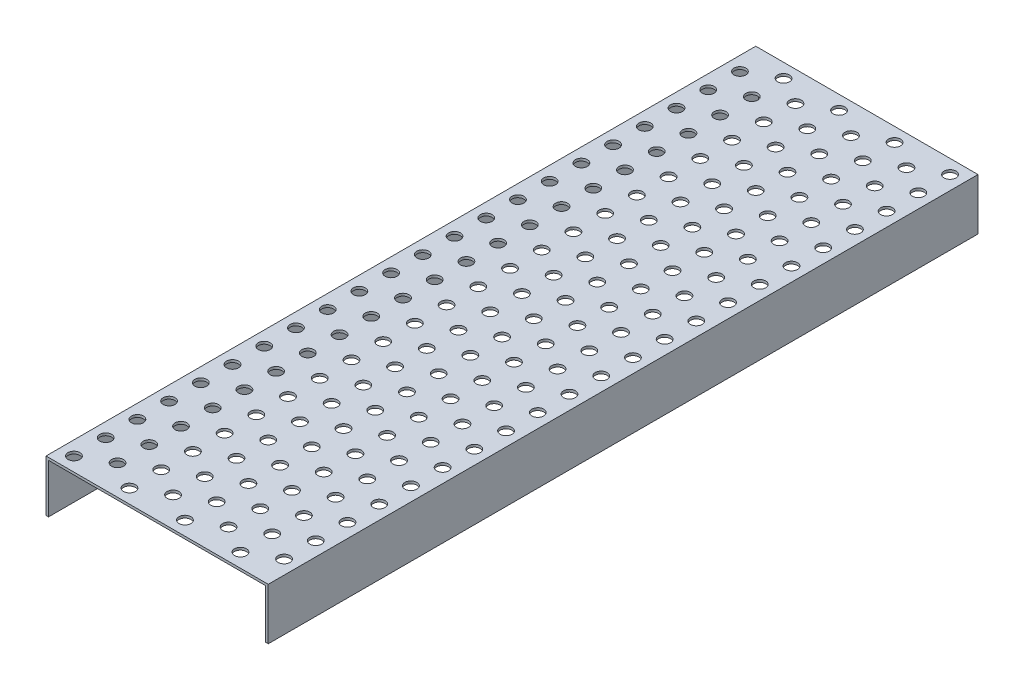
from build123d import *

# Parameters (mm, degrees)
SALIENTE_EXTRUIR1_DEPTH = 568.452
CROQUIS3_R              = 4.7625
CORTAR_EXTRUIR1_DEPTH   = 2


with BuildPart() as part:
    # Croquis2 → Saliente-Extruir1 (new body)
    with BuildSketch(Plane.XY):
        Polygon((0, 0), (0, 41.275), (178, 41.275), (178, 0), (176, 0), (176, 39.275), (2, 39.275), (2, 0), align=None)
    extrude(amount=SALIENTE_EXTRUIR1_DEPTH)

    # Croquis3 → Cortar-Extruir1 (cut)
    with BuildSketch(Plane(origin=(0, 41.275, 0), x_dir=(1, 0, 0), z_dir=(0, 1, 0))):
        with Locations(Location((11.2125, -23.876, 0), (0, 0, 270))):
            Circle(CROQUIS3_R)
        with Locations(Location((33.4375, -11.176, 0), (0, 0, 270))):
            Circle(CROQUIS3_R)
        with Locations(Location((55.6625, -23.876, 0), (0, 0, 270))):
            Circle(CROQUIS3_R)
        with Locations(Location((100.1125, -23.876, 0), (0, 0, 270))):
            Circle(CROQUIS3_R)
        with Locations(Location((144.5625, -23.876, 0), (0, 0, 270))):
            Circle(CROQUIS3_R)
        with Locations(Location((11.2125, -49.276, 0), (0, 0, 270))):
            Circle(CROQUIS3_R)
        with Locations(Location((55.6625, -49.276, 0), (0, 0, 270))):
            Circle(CROQUIS3_R)
        with Locations(Location((100.1125, -49.276, 0), (0, 0, 270))):
            Circle(CROQUIS3_R)
        with Locations(Location((144.5625, -49.276, 0), (0, 0, 270))):
            Circle(CROQUIS3_R)
        with Locations(Location((11.2125, -74.676, 0), (0, 0, 270))):
            Circle(CROQUIS3_R)
        with Locations(Location((55.6625, -74.676, 0), (0, 0, 270))):
            Circle(CROQUIS3_R)
        with Locations(Location((100.1125, -74.676, 0), (0, 0, 270))):
            Circle(CROQUIS3_R)
        with Locations(Location((144.5625, -74.676, 0), (0, 0, 270))):
            Circle(CROQUIS3_R)
        with Locations(Location((11.2125, -100.076, 0), (0, 0, 270))):
            Circle(CROQUIS3_R)
        with Locations(Location((55.6625, -100.076, 0), (0, 0, 270))):
            Circle(CROQUIS3_R)
        with Locations(Location((100.1125, -100.076, 0), (0, 0, 270))):
            Circle(CROQUIS3_R)
        with Locations(Location((144.5625, -100.076, 0), (0, 0, 270))):
            Circle(CROQUIS3_R)
        with Locations(Location((11.2125, -125.476, 0), (0, 0, 270))):
            Circle(CROQUIS3_R)
        with Locations(Location((55.6625, -125.476, 0), (0, 0, 270))):
            Circle(CROQUIS3_R)
        with Locations(Location((100.1125, -125.476, 0), (0, 0, 270))):
            Circle(CROQUIS3_R)
        with Locations(Location((144.5625, -125.476, 0), (0, 0, 270))):
            Circle(CROQUIS3_R)
        with Locations(Location((11.2125, -150.876, 0), (0, 0, 270))):
            Circle(CROQUIS3_R)
        with Locations(Location((55.6625, -150.876, 0), (0, 0, 270))):
            Circle(CROQUIS3_R)
        with Locations(Location((100.1125, -150.876, 0), (0, 0, 270))):
            Circle(CROQUIS3_R)
        with Locations(Location((144.5625, -150.876, 0), (0, 0, 270))):
            Circle(CROQUIS3_R)
        with Locations(Location((11.2125, -176.276, 0), (0, 0, 270))):
            Circle(CROQUIS3_R)
        with Locations(Location((55.6625, -176.276, 0), (0, 0, 270))):
            Circle(CROQUIS3_R)
        with Locations(Location((100.1125, -176.276, 0), (0, 0, 270))):
            Circle(CROQUIS3_R)
        with Locations(Location((144.5625, -176.276, 0), (0, 0, 270))):
            Circle(CROQUIS3_R)
        with Locations(Location((11.2125, -201.676, 0), (0, 0, 270))):
            Circle(CROQUIS3_R)
        with Locations(Location((55.6625, -201.676, 0), (0, 0, 270))):
            Circle(CROQUIS3_R)
        with Locations(Location((100.1125, -201.676, 0), (0, 0, 270))):
            Circle(CROQUIS3_R)
        with Locations(Location((144.5625, -201.676, 0), (0, 0, 270))):
            Circle(CROQUIS3_R)
        with Locations(Location((11.2125, -227.076, 0), (0, 0, 270))):
            Circle(CROQUIS3_R)
        with Locations(Location((55.6625, -227.076, 0), (0, 0, 270))):
            Circle(CROQUIS3_R)
        with Locations(Location((100.1125, -227.076, 0), (0, 0, 270))):
            Circle(CROQUIS3_R)
        with Locations(Location((144.5625, -227.076, 0), (0, 0, 270))):
            Circle(CROQUIS3_R)
        with Locations(Location((11.2125, -252.476, 0), (0, 0, 270))):
            Circle(CROQUIS3_R)
        with Locations(Location((55.6625, -252.476, 0), (0, 0, 270))):
            Circle(CROQUIS3_R)
        with Locations(Location((100.1125, -252.476, 0), (0, 0, 270))):
            Circle(CROQUIS3_R)
        with Locations(Location((144.5625, -252.476, 0), (0, 0, 270))):
            Circle(CROQUIS3_R)
        with Locations(Location((11.2125, -277.876, 0), (0, 0, 270))):
            Circle(CROQUIS3_R)
        with Locations(Location((55.6625, -277.876, 0), (0, 0, 270))):
            Circle(CROQUIS3_R)
        with Locations(Location((100.1125, -277.876, 0), (0, 0, 270))):
            Circle(CROQUIS3_R)
        with Locations(Location((144.5625, -277.876, 0), (0, 0, 270))):
            Circle(CROQUIS3_R)
        with Locations(Location((11.2125, -303.276, 0), (0, 0, 270))):
            Circle(CROQUIS3_R)
        with Locations(Location((55.6625, -303.276, 0), (0, 0, 270))):
            Circle(CROQUIS3_R)
        with Locations(Location((100.1125, -303.276, 0), (0, 0, 270))):
            Circle(CROQUIS3_R)
        with Locations(Location((144.5625, -303.276, 0), (0, 0, 270))):
            Circle(CROQUIS3_R)
        with Locations(Location((11.2125, -328.676, 0), (0, 0, 270))):
            Circle(CROQUIS3_R)
        with Locations(Location((55.6625, -328.676, 0), (0, 0, 270))):
            Circle(CROQUIS3_R)
        with Locations(Location((100.1125, -328.676, 0), (0, 0, 270))):
            Circle(CROQUIS3_R)
        with Locations(Location((144.5625, -328.676, 0), (0, 0, 270))):
            Circle(CROQUIS3_R)
        with Locations(Location((11.2125, -354.076, 0), (0, 0, 270))):
            Circle(CROQUIS3_R)
        with Locations(Location((55.6625, -354.076, 0), (0, 0, 270))):
            Circle(CROQUIS3_R)
        with Locations(Location((100.1125, -354.076, 0), (0, 0, 270))):
            Circle(CROQUIS3_R)
        with Locations(Location((144.5625, -354.076, 0), (0, 0, 270))):
            Circle(CROQUIS3_R)
        with Locations(Location((11.2125, -379.476, 0), (0, 0, 270))):
            Circle(CROQUIS3_R)
        with Locations(Location((55.6625, -379.476, 0), (0, 0, 270))):
            Circle(CROQUIS3_R)
        with Locations(Location((100.1125, -379.476, 0), (0, 0, 270))):
            Circle(CROQUIS3_R)
        with Locations(Location((144.5625, -379.476, 0), (0, 0, 270))):
            Circle(CROQUIS3_R)
        with Locations(Location((11.2125, -404.876, 0), (0, 0, 270))):
            Circle(CROQUIS3_R)
        with Locations(Location((55.6625, -404.876, 0), (0, 0, 270))):
            Circle(CROQUIS3_R)
        with Locations(Location((100.1125, -404.876, 0), (0, 0, 270))):
            Circle(CROQUIS3_R)
        with Locations(Location((144.5625, -404.876, 0), (0, 0, 270))):
            Circle(CROQUIS3_R)
        with Locations(Location((11.2125, -430.276, 0), (0, 0, 270))):
            Circle(CROQUIS3_R)
        with Locations(Location((55.6625, -430.276, 0), (0, 0, 270))):
            Circle(CROQUIS3_R)
        with Locations(Location((100.1125, -430.276, 0), (0, 0, 270))):
            Circle(CROQUIS3_R)
        with Locations(Location((144.5625, -430.276, 0), (0, 0, 270))):
            Circle(CROQUIS3_R)
        with Locations(Location((11.2125, -455.676, 0), (0, 0, 270))):
            Circle(CROQUIS3_R)
        with Locations(Location((55.6625, -455.676, 0), (0, 0, 270))):
            Circle(CROQUIS3_R)
        with Locations(Location((100.1125, -455.676, 0), (0, 0, 270))):
            Circle(CROQUIS3_R)
        with Locations(Location((144.5625, -455.676, 0), (0, 0, 270))):
            Circle(CROQUIS3_R)
        with Locations(Location((11.2125, -481.076, 0), (0, 0, 270))):
            Circle(CROQUIS3_R)
        with Locations(Location((55.6625, -481.076, 0), (0, 0, 270))):
            Circle(CROQUIS3_R)
        with Locations(Location((100.1125, -481.076, 0), (0, 0, 270))):
            Circle(CROQUIS3_R)
        with Locations(Location((144.5625, -481.076, 0), (0, 0, 270))):
            Circle(CROQUIS3_R)
        with Locations(Location((11.2125, -506.476, 0), (0, 0, 270))):
            Circle(CROQUIS3_R)
        with Locations(Location((55.6625, -506.476, 0), (0, 0, 270))):
            Circle(CROQUIS3_R)
        with Locations(Location((100.1125, -506.476, 0), (0, 0, 270))):
            Circle(CROQUIS3_R)
        with Locations(Location((144.5625, -506.476, 0), (0, 0, 270))):
            Circle(CROQUIS3_R)
        with Locations(Location((11.2125, -531.876, 0), (0, 0, 270))):
            Circle(CROQUIS3_R)
        with Locations(Location((55.6625, -531.876, 0), (0, 0, 270))):
            Circle(CROQUIS3_R)
        with Locations(Location((100.1125, -531.876, 0), (0, 0, 270))):
            Circle(CROQUIS3_R)
        with Locations(Location((144.5625, -531.876, 0), (0, 0, 270))):
            Circle(CROQUIS3_R)
        with Locations(Location((11.2125, -557.276, 0), (0, 0, 270))):
            Circle(CROQUIS3_R)
        with Locations(Location((55.6625, -557.276, 0), (0, 0, 270))):
            Circle(CROQUIS3_R)
        with Locations(Location((100.1125, -557.276, 0), (0, 0, 270))):
            Circle(CROQUIS3_R)
        with Locations(Location((144.5625, -557.276, 0), (0, 0, 270))):
            Circle(CROQUIS3_R)
        with Locations(Location((77.8875, -11.176, 0), (0, 0, 270))):
            Circle(CROQUIS3_R)
        with Locations(Location((122.3375, -11.176, 0), (0, 0, 270))):
            Circle(CROQUIS3_R)
        with Locations(Location((166.7875, -11.176, 0), (0, 0, 270))):
            Circle(CROQUIS3_R)
        with Locations(Location((33.4375, -36.576, 0), (0, 0, 270))):
            Circle(CROQUIS3_R)
        with Locations(Location((77.8875, -36.576, 0), (0, 0, 270))):
            Circle(CROQUIS3_R)
        with Locations(Location((122.3375, -36.576, 0), (0, 0, 270))):
            Circle(CROQUIS3_R)
        with Locations(Location((166.7875, -36.576, 0), (0, 0, 270))):
            Circle(CROQUIS3_R)
        with Locations(Location((33.4375, -61.976, 0), (0, 0, 270))):
            Circle(CROQUIS3_R)
        with Locations(Location((77.8875, -61.976, 0), (0, 0, 270))):
            Circle(CROQUIS3_R)
        with Locations(Location((122.3375, -61.976, 0), (0, 0, 270))):
            Circle(CROQUIS3_R)
        with Locations(Location((166.7875, -61.976, 0), (0, 0, 270))):
            Circle(CROQUIS3_R)
        with Locations(Location((33.4375, -87.376, 0), (0, 0, 270))):
            Circle(CROQUIS3_R)
        with Locations(Location((77.8875, -87.376, 0), (0, 0, 270))):
            Circle(CROQUIS3_R)
        with Locations(Location((122.3375, -87.376, 0), (0, 0, 270))):
            Circle(CROQUIS3_R)
        with Locations(Location((166.7875, -87.376, 0), (0, 0, 270))):
            Circle(CROQUIS3_R)
        with Locations(Location((33.4375, -112.776, 0), (0, 0, 270))):
            Circle(CROQUIS3_R)
        with Locations(Location((77.8875, -112.776, 0), (0, 0, 270))):
            Circle(CROQUIS3_R)
        with Locations(Location((122.3375, -112.776, 0), (0, 0, 270))):
            Circle(CROQUIS3_R)
        with Locations(Location((166.7875, -112.776, 0), (0, 0, 270))):
            Circle(CROQUIS3_R)
        with Locations(Location((33.4375, -138.176, 0), (0, 0, 270))):
            Circle(CROQUIS3_R)
        with Locations(Location((77.8875, -138.176, 0), (0, 0, 270))):
            Circle(CROQUIS3_R)
        with Locations(Location((122.3375, -138.176, 0), (0, 0, 270))):
            Circle(CROQUIS3_R)
        with Locations(Location((166.7875, -138.176, 0), (0, 0, 270))):
            Circle(CROQUIS3_R)
        with Locations(Location((33.4375, -163.576, 0), (0, 0, 270))):
            Circle(CROQUIS3_R)
        with Locations(Location((77.8875, -163.576, 0), (0, 0, 270))):
            Circle(CROQUIS3_R)
        with Locations(Location((122.3375, -163.576, 0), (0, 0, 270))):
            Circle(CROQUIS3_R)
        with Locations(Location((166.7875, -163.576, 0), (0, 0, 270))):
            Circle(CROQUIS3_R)
        with Locations(Location((33.4375, -188.976, 0), (0, 0, 270))):
            Circle(CROQUIS3_R)
        with Locations(Location((77.8875, -188.976, 0), (0, 0, 270))):
            Circle(CROQUIS3_R)
        with Locations(Location((122.3375, -188.976, 0), (0, 0, 270))):
            Circle(CROQUIS3_R)
        with Locations(Location((166.7875, -188.976, 0), (0, 0, 270))):
            Circle(CROQUIS3_R)
        with Locations(Location((33.4375, -214.376, 0), (0, 0, 270))):
            Circle(CROQUIS3_R)
        with Locations(Location((77.8875, -214.376, 0), (0, 0, 270))):
            Circle(CROQUIS3_R)
        with Locations(Location((122.3375, -214.376, 0), (0, 0, 270))):
            Circle(CROQUIS3_R)
        with Locations(Location((166.7875, -214.376, 0), (0, 0, 270))):
            Circle(CROQUIS3_R)
        with Locations(Location((33.4375, -239.776, 0), (0, 0, 270))):
            Circle(CROQUIS3_R)
        with Locations(Location((77.8875, -239.776, 0), (0, 0, 270))):
            Circle(CROQUIS3_R)
        with Locations(Location((122.3375, -239.776, 0), (0, 0, 270))):
            Circle(CROQUIS3_R)
        with Locations(Location((166.7875, -239.776, 0), (0, 0, 270))):
            Circle(CROQUIS3_R)
        with Locations(Location((33.4375, -265.176, 0), (0, 0, 270))):
            Circle(CROQUIS3_R)
        with Locations(Location((77.8875, -265.176, 0), (0, 0, 270))):
            Circle(CROQUIS3_R)
        with Locations(Location((122.3375, -265.176, 0), (0, 0, 270))):
            Circle(CROQUIS3_R)
        with Locations(Location((166.7875, -265.176, 0), (0, 0, 270))):
            Circle(CROQUIS3_R)
        with Locations(Location((33.4375, -290.576, 0), (0, 0, 270))):
            Circle(CROQUIS3_R)
        with Locations(Location((77.8875, -290.576, 0), (0, 0, 270))):
            Circle(CROQUIS3_R)
        with Locations(Location((122.3375, -290.576, 0), (0, 0, 270))):
            Circle(CROQUIS3_R)
        with Locations(Location((166.7875, -290.576, 0), (0, 0, 270))):
            Circle(CROQUIS3_R)
        with Locations(Location((33.4375, -315.976, 0), (0, 0, 270))):
            Circle(CROQUIS3_R)
        with Locations(Location((77.8875, -315.976, 0), (0, 0, 270))):
            Circle(CROQUIS3_R)
        with Locations(Location((122.3375, -315.976, 0), (0, 0, 270))):
            Circle(CROQUIS3_R)
        with Locations(Location((166.7875, -315.976, 0), (0, 0, 270))):
            Circle(CROQUIS3_R)
        with Locations(Location((33.4375, -341.376, 0), (0, 0, 270))):
            Circle(CROQUIS3_R)
        with Locations(Location((77.8875, -341.376, 0), (0, 0, 270))):
            Circle(CROQUIS3_R)
        with Locations(Location((122.3375, -341.376, 0), (0, 0, 270))):
            Circle(CROQUIS3_R)
        with Locations(Location((166.7875, -341.376, 0), (0, 0, 270))):
            Circle(CROQUIS3_R)
        with Locations(Location((33.4375, -366.776, 0), (0, 0, 270))):
            Circle(CROQUIS3_R)
        with Locations(Location((77.8875, -366.776, 0), (0, 0, 270))):
            Circle(CROQUIS3_R)
        with Locations(Location((122.3375, -366.776, 0), (0, 0, 270))):
            Circle(CROQUIS3_R)
        with Locations(Location((166.7875, -366.776, 0), (0, 0, 270))):
            Circle(CROQUIS3_R)
        with Locations(Location((33.4375, -392.176, 0), (0, 0, 270))):
            Circle(CROQUIS3_R)
        with Locations(Location((77.8875, -392.176, 0), (0, 0, 270))):
            Circle(CROQUIS3_R)
        with Locations(Location((122.3375, -392.176, 0), (0, 0, 270))):
            Circle(CROQUIS3_R)
        with Locations(Location((166.7875, -392.176, 0), (0, 0, 270))):
            Circle(CROQUIS3_R)
        with Locations(Location((33.4375, -417.576, 0), (0, 0, 270))):
            Circle(CROQUIS3_R)
        with Locations(Location((77.8875, -417.576, 0), (0, 0, 270))):
            Circle(CROQUIS3_R)
        with Locations(Location((122.3375, -417.576, 0), (0, 0, 270))):
            Circle(CROQUIS3_R)
        with Locations(Location((166.7875, -417.576, 0), (0, 0, 270))):
            Circle(CROQUIS3_R)
        with Locations(Location((33.4375, -442.976, 0), (0, 0, 270))):
            Circle(CROQUIS3_R)
        with Locations(Location((77.8875, -442.976, 0), (0, 0, 270))):
            Circle(CROQUIS3_R)
        with Locations(Location((122.3375, -442.976, 0), (0, 0, 270))):
            Circle(CROQUIS3_R)
        with Locations(Location((166.7875, -442.976, 0), (0, 0, 270))):
            Circle(CROQUIS3_R)
        with Locations(Location((33.4375, -468.376, 0), (0, 0, 270))):
            Circle(CROQUIS3_R)
        with Locations(Location((77.8875, -468.376, 0), (0, 0, 270))):
            Circle(CROQUIS3_R)
        with Locations(Location((122.3375, -468.376, 0), (0, 0, 270))):
            Circle(CROQUIS3_R)
        with Locations(Location((166.7875, -468.376, 0), (0, 0, 270))):
            Circle(CROQUIS3_R)
        with Locations(Location((33.4375, -493.776, 0), (0, 0, 270))):
            Circle(CROQUIS3_R)
        with Locations(Location((77.8875, -493.776, 0), (0, 0, 270))):
            Circle(CROQUIS3_R)
        with Locations(Location((122.3375, -493.776, 0), (0, 0, 270))):
            Circle(CROQUIS3_R)
        with Locations(Location((166.7875, -493.776, 0), (0, 0, 270))):
            Circle(CROQUIS3_R)
        with Locations(Location((33.4375, -519.176, 0), (0, 0, 270))):
            Circle(CROQUIS3_R)
        with Locations(Location((77.8875, -519.176, 0), (0, 0, 270))):
            Circle(CROQUIS3_R)
        with Locations(Location((122.3375, -519.176, 0), (0, 0, 270))):
            Circle(CROQUIS3_R)
        with Locations(Location((166.7875, -519.176, 0), (0, 0, 270))):
            Circle(CROQUIS3_R)
        with Locations(Location((33.4375, -544.576, 0), (0, 0, 270))):
            Circle(CROQUIS3_R)
        with Locations(Location((77.8875, -544.576, 0), (0, 0, 270))):
            Circle(CROQUIS3_R)
        with Locations(Location((122.3375, -544.576, 0), (0, 0, 270))):
            Circle(CROQUIS3_R)
        with Locations(Location((166.7875, -544.576, 0), (0, 0, 270))):
            Circle(CROQUIS3_R)
    extrude(amount=-CORTAR_EXTRUIR1_DEPTH, mode=Mode.SUBTRACT)


solid = part.part
